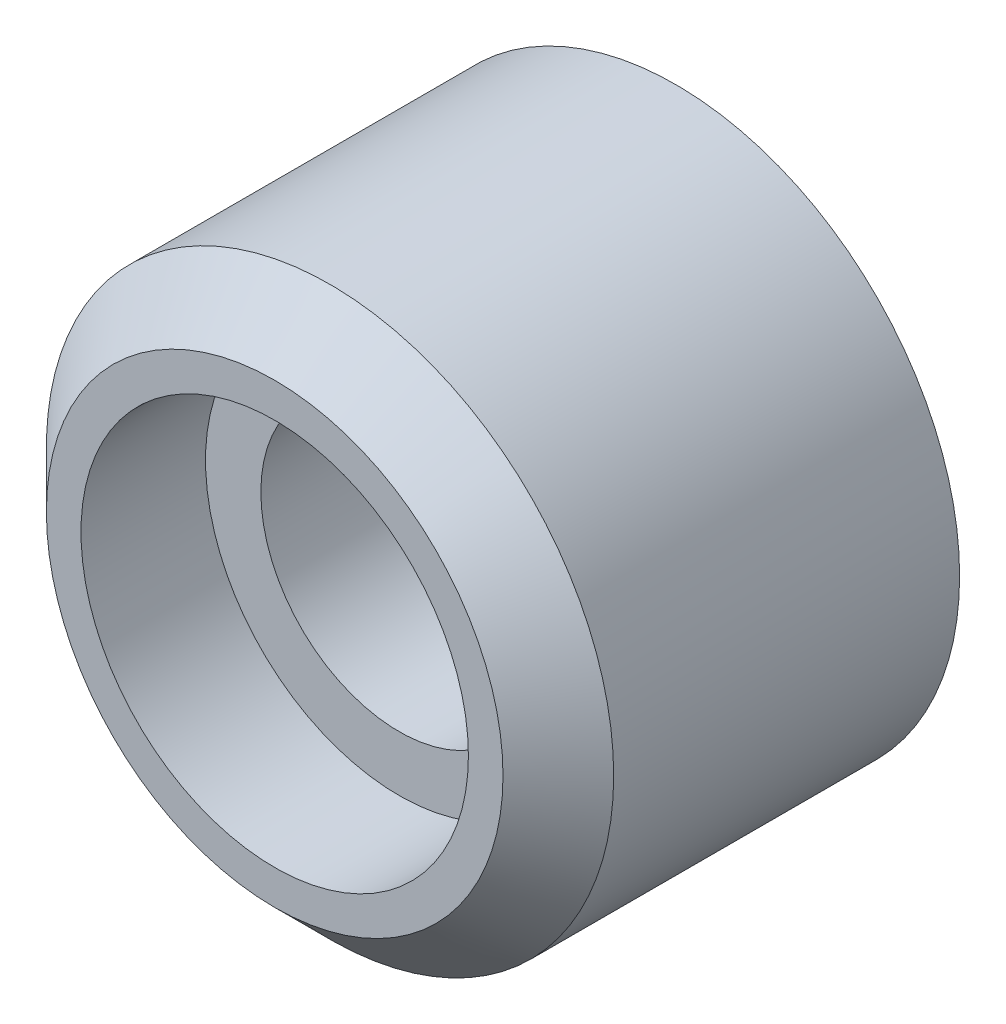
ISO-10303-21;
HEADER;
FILE_DESCRIPTION(('STEP AP214'),'2;1');
FILE_NAME('part.step','',(''),(''),'','','');
FILE_SCHEMA(('AUTOMOTIVE_DESIGN { 1 0 10303 214 1 1 1 1 }'));
ENDSEC;
DATA;
#1=APPLICATION_CONTEXT('core data for automotive mechanical design processes');
#2=APPLICATION_PROTOCOL_DEFINITION('international standard','automotive_design',2000,#1);
#3=PRODUCT_CONTEXT('',#1,'mechanical');
#4=PRODUCT('Part','Part','',(#3));
#5=PRODUCT_RELATED_PRODUCT_CATEGORY('part','',(#4));
#6=PRODUCT_DEFINITION_FORMATION('','',#4);
#7=PRODUCT_DEFINITION_CONTEXT('part definition',#1,'design');
#8=PRODUCT_DEFINITION('design','',#6,#7);
#9=PRODUCT_DEFINITION_SHAPE('','',#8);
#10=(LENGTH_UNIT() NAMED_UNIT(*) SI_UNIT(.MILLI.,.METRE.));
#11=(NAMED_UNIT(*) PLANE_ANGLE_UNIT() SI_UNIT($,.RADIAN.));
#12=(NAMED_UNIT(*) SI_UNIT($,.STERADIAN.) SOLID_ANGLE_UNIT());
#13=UNCERTAINTY_MEASURE_WITH_UNIT(LENGTH_MEASURE(1.E-05),#10,'distance_accuracy_value','');
#14=(GEOMETRIC_REPRESENTATION_CONTEXT(3) GLOBAL_UNCERTAINTY_ASSIGNED_CONTEXT((#13)) GLOBAL_UNIT_ASSIGNED_CONTEXT((#10,
#11,#12)) REPRESENTATION_CONTEXT('',''));
#15=CARTESIAN_POINT('',(0.,0.,0.));
#16=DIRECTION('',(0.,0.,1.));
#17=DIRECTION('',(1.,0.,0.));
#18=AXIS2_PLACEMENT_3D('',#15,#16,#17);
#19=CARTESIAN_POINT('',(0.,0.,-14.5));
#20=DIRECTION('',(0.,0.,1.));
#21=DIRECTION('',(1.,0.,0.));
#22=AXIS2_PLACEMENT_3D('',#19,#20,#21);
#23=CYLINDRICAL_SURFACE('',#22,5.);
#24=CARTESIAN_POINT('',(0.,0.,-14.5));
#25=DIRECTION('',(0.,0.,1.));
#26=DIRECTION('',(1.,0.,0.));
#27=AXIS2_PLACEMENT_3D('',#24,#25,#26);
#28=CIRCLE('',#27,5.);
#29=CARTESIAN_POINT('',(5.,0.,-14.5));
#30=VERTEX_POINT('',#29);
#31=EDGE_CURVE('E48',#30,#30,#28,.T.);
#32=CARTESIAN_POINT('',(0.,0.,-4.5));
#33=DIRECTION('',(0.,0.,1.));
#34=DIRECTION('',(1.,0.,0.));
#35=AXIS2_PLACEMENT_3D('',#32,#33,#34);
#36=CIRCLE('',#35,5.);
#37=CARTESIAN_POINT('',(5.,0.,-4.5));
#38=VERTEX_POINT('',#37);
#39=EDGE_CURVE('E51',#38,#38,#36,.F.);
#40=CARTESIAN_POINT('',(5.,0.,-14.5));
#41=CARTESIAN_POINT('',(5.,0.,-14.3958333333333));
#42=CARTESIAN_POINT('',(5.,0.,-14.2916666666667));
#43=CARTESIAN_POINT('',(5.,0.,-14.0833333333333));
#44=CARTESIAN_POINT('',(5.,0.,-13.9791666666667));
#45=CARTESIAN_POINT('',(5.,0.,-13.7708333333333));
#46=CARTESIAN_POINT('',(5.,0.,-13.6666666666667));
#47=CARTESIAN_POINT('',(5.,0.,-13.4583333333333));
#48=CARTESIAN_POINT('',(5.,0.,-13.3541666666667));
#49=CARTESIAN_POINT('',(5.,0.,-13.1458333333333));
#50=CARTESIAN_POINT('',(5.,0.,-13.0416666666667));
#51=CARTESIAN_POINT('',(5.,0.,-12.8333333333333));
#52=CARTESIAN_POINT('',(5.,0.,-12.7291666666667));
#53=CARTESIAN_POINT('',(5.,0.,-12.5208333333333));
#54=CARTESIAN_POINT('',(5.,0.,-12.4166666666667));
#55=CARTESIAN_POINT('',(5.,0.,-12.2083333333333));
#56=CARTESIAN_POINT('',(5.,0.,-12.1041666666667));
#57=CARTESIAN_POINT('',(5.,0.,-11.8958333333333));
#58=CARTESIAN_POINT('',(5.,0.,-11.7916666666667));
#59=CARTESIAN_POINT('',(5.,0.,-11.5833333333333));
#60=CARTESIAN_POINT('',(5.,0.,-11.4791666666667));
#61=CARTESIAN_POINT('',(5.,0.,-11.2708333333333));
#62=CARTESIAN_POINT('',(5.,0.,-11.1666666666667));
#63=CARTESIAN_POINT('',(5.,0.,-10.9583333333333));
#64=CARTESIAN_POINT('',(5.,0.,-10.8541666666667));
#65=CARTESIAN_POINT('',(5.,0.,-10.6458333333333));
#66=CARTESIAN_POINT('',(5.,0.,-10.5416666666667));
#67=CARTESIAN_POINT('',(5.,0.,-10.3333333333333));
#68=CARTESIAN_POINT('',(5.,0.,-10.2291666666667));
#69=CARTESIAN_POINT('',(5.,0.,-10.0208333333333));
#70=CARTESIAN_POINT('',(5.,0.,-9.91666666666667));
#71=CARTESIAN_POINT('',(5.,0.,-9.70833333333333));
#72=CARTESIAN_POINT('',(5.,0.,-9.60416666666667));
#73=CARTESIAN_POINT('',(5.,0.,-9.39583333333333));
#74=CARTESIAN_POINT('',(5.,0.,-9.29166666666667));
#75=CARTESIAN_POINT('',(5.,0.,-9.08333333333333));
#76=CARTESIAN_POINT('',(5.,0.,-8.97916666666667));
#77=CARTESIAN_POINT('',(5.,0.,-8.77083333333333));
#78=CARTESIAN_POINT('',(5.,0.,-8.66666666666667));
#79=CARTESIAN_POINT('',(5.,0.,-8.45833333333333));
#80=CARTESIAN_POINT('',(5.,0.,-8.35416666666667));
#81=CARTESIAN_POINT('',(5.,0.,-8.14583333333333));
#82=CARTESIAN_POINT('',(5.,0.,-8.04166666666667));
#83=CARTESIAN_POINT('',(5.,0.,-7.83333333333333));
#84=CARTESIAN_POINT('',(5.,0.,-7.72916666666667));
#85=CARTESIAN_POINT('',(5.,0.,-7.52083333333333));
#86=CARTESIAN_POINT('',(5.,0.,-7.41666666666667));
#87=CARTESIAN_POINT('',(5.,0.,-7.20833333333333));
#88=CARTESIAN_POINT('',(5.,0.,-7.10416666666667));
#89=CARTESIAN_POINT('',(5.,0.,-6.89583333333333));
#90=CARTESIAN_POINT('',(5.,0.,-6.79166666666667));
#91=CARTESIAN_POINT('',(5.,0.,-6.58333333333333));
#92=CARTESIAN_POINT('',(5.,0.,-6.47916666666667));
#93=CARTESIAN_POINT('',(5.,0.,-6.27083333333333));
#94=CARTESIAN_POINT('',(5.,0.,-6.16666666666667));
#95=CARTESIAN_POINT('',(5.,0.,-5.95833333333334));
#96=CARTESIAN_POINT('',(5.,0.,-5.85416666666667));
#97=CARTESIAN_POINT('',(5.,0.,-5.64583333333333));
#98=CARTESIAN_POINT('',(5.,0.,-5.54166666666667));
#99=CARTESIAN_POINT('',(5.,0.,-5.33333333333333));
#100=CARTESIAN_POINT('',(5.,0.,-5.22916666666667));
#101=CARTESIAN_POINT('',(5.,0.,-5.02083333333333));
#102=CARTESIAN_POINT('',(5.,0.,-4.91666666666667));
#103=CARTESIAN_POINT('',(5.,0.,-4.70833333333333));
#104=CARTESIAN_POINT('',(5.,0.,-4.60416666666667));
#105=CARTESIAN_POINT('',(5.,0.,-4.5));
#106=B_SPLINE_CURVE_WITH_KNOTS('',3,(#40,#41,#42,#43,#44,#45,#46,#47,#48,#49,#50,#51,#52,#53,
#54,#55,#56,#57,#58,#59,#60,#61,#62,#63,#64,#65,#66,#67,#68,#69,#70,#71,#72,#73,#74,#75,#76,#77,
#78,#79,#80,#81,#82,#83,#84,#85,#86,#87,#88,#89,#90,#91,#92,#93,#94,#95,#96,#97,#98,#99,#100,
#101,#102,#103,#104,#105),.UNSPECIFIED.,.F.,.F.,(4,2,2,2,2,2,2,2,2,2,2,2,2,2,2,2,2,2,2,2,2,2,2,
2,2,2,2,2,2,2,2,2,4),(0.,0.3125,0.625000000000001,0.937500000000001,1.25,1.5625,1.875,2.1875,
2.5,2.8125,3.125,3.4375,3.75,4.0625,4.375,4.6875,5.,5.3125,5.625,5.9375,6.25,6.5625,6.875,
7.1875,7.5,7.8125,8.125,8.4375,8.75,9.0625,9.375,9.6875,10.),.UNSPECIFIED.);
#107=EDGE_CURVE('BSEAM33',#30,#38,#106,.T.);
#108=ORIENTED_EDGE('',*,*,#31,.F.);
#109=ORIENTED_EDGE('',*,*,#39,.F.);
#110=ORIENTED_EDGE('',*,*,#107,.T.);
#111=ORIENTED_EDGE('',*,*,#107,.F.);
#112=EDGE_LOOP('',(#108,#110,#109,#111));
#113=FACE_BOUND('',#112,.T.);
#114=ADVANCED_FACE('F33',(#113),#23,.F.);
#115=CARTESIAN_POINT('',(0.,0.,-14.5));
#116=DIRECTION('',(0.,0.,1.));
#117=DIRECTION('',(1.,0.,0.));
#118=AXIS2_PLACEMENT_3D('',#115,#116,#117);
#119=CYLINDRICAL_SURFACE('',#118,10.25);
#120=CARTESIAN_POINT('',(0.,0.,-1.99999999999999));
#121=DIRECTION('',(0.,0.,1.));
#122=DIRECTION('',(1.,0.,0.));
#123=AXIS2_PLACEMENT_3D('',#120,#121,#122);
#124=CIRCLE('',#123,10.25);
#125=CARTESIAN_POINT('',(10.25,0.,-1.99999999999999));
#126=VERTEX_POINT('',#125);
#127=EDGE_CURVE('E10',#126,#126,#124,.F.);
#128=CARTESIAN_POINT('',(0.,0.,-14.5));
#129=DIRECTION('',(0.,0.,1.));
#130=DIRECTION('',(1.,0.,0.));
#131=AXIS2_PLACEMENT_3D('',#128,#129,#130);
#132=CIRCLE('',#131,10.25);
#133=CARTESIAN_POINT('',(10.25,0.,-14.5));
#134=VERTEX_POINT('',#133);
#135=EDGE_CURVE('E44',#134,#134,#132,.T.);
#136=CARTESIAN_POINT('',(10.25,0.,-1.99999999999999));
#137=CARTESIAN_POINT('',(10.25,0.,-2.13020833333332));
#138=CARTESIAN_POINT('',(10.25,0.,-2.26041666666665));
#139=CARTESIAN_POINT('',(10.25,0.,-2.52083333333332));
#140=CARTESIAN_POINT('',(10.25,0.,-2.65104166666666));
#141=CARTESIAN_POINT('',(10.25,0.,-2.91145833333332));
#142=CARTESIAN_POINT('',(10.25,0.,-3.04166666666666));
#143=CARTESIAN_POINT('',(10.25,0.,-3.30208333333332));
#144=CARTESIAN_POINT('',(10.25,0.,-3.43229166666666));
#145=CARTESIAN_POINT('',(10.25,0.,-3.69270833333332));
#146=CARTESIAN_POINT('',(10.25,0.,-3.82291666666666));
#147=CARTESIAN_POINT('',(10.25,0.,-4.08333333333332));
#148=CARTESIAN_POINT('',(10.25,0.,-4.21354166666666));
#149=CARTESIAN_POINT('',(10.25,0.,-4.47395833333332));
#150=CARTESIAN_POINT('',(10.25,0.,-4.60416666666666));
#151=CARTESIAN_POINT('',(10.25,0.,-4.86458333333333));
#152=CARTESIAN_POINT('',(10.25,0.,-4.99479166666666));
#153=CARTESIAN_POINT('',(10.25,0.,-5.25520833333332));
#154=CARTESIAN_POINT('',(10.25,0.,-5.38541666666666));
#155=CARTESIAN_POINT('',(10.25,0.,-5.64583333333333));
#156=CARTESIAN_POINT('',(10.25,0.,-5.77604166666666));
#157=CARTESIAN_POINT('',(10.25,0.,-6.03645833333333));
#158=CARTESIAN_POINT('',(10.25,0.,-6.16666666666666));
#159=CARTESIAN_POINT('',(10.25,0.,-6.42708333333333));
#160=CARTESIAN_POINT('',(10.25,0.,-6.55729166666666));
#161=CARTESIAN_POINT('',(10.25,0.,-6.81770833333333));
#162=CARTESIAN_POINT('',(10.25,0.,-6.94791666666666));
#163=CARTESIAN_POINT('',(10.25,0.,-7.20833333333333));
#164=CARTESIAN_POINT('',(10.25,0.,-7.33854166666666));
#165=CARTESIAN_POINT('',(10.25,0.,-7.59895833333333));
#166=CARTESIAN_POINT('',(10.25,0.,-7.72916666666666));
#167=CARTESIAN_POINT('',(10.25,0.,-7.98958333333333));
#168=CARTESIAN_POINT('',(10.25,0.,-8.11979166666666));
#169=CARTESIAN_POINT('',(10.25,0.,-8.38020833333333));
#170=CARTESIAN_POINT('',(10.25,0.,-8.51041666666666));
#171=CARTESIAN_POINT('',(10.25,0.,-8.77083333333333));
#172=CARTESIAN_POINT('',(10.25,0.,-8.90104166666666));
#173=CARTESIAN_POINT('',(10.25,0.,-9.16145833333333));
#174=CARTESIAN_POINT('',(10.25,0.,-9.29166666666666));
#175=CARTESIAN_POINT('',(10.25,0.,-9.55208333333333));
#176=CARTESIAN_POINT('',(10.25,0.,-9.68229166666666));
#177=CARTESIAN_POINT('',(10.25,0.,-9.94270833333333));
#178=CARTESIAN_POINT('',(10.25,0.,-10.0729166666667));
#179=CARTESIAN_POINT('',(10.25,0.,-10.3333333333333));
#180=CARTESIAN_POINT('',(10.25,0.,-10.4635416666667));
#181=CARTESIAN_POINT('',(10.25,0.,-10.7239583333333));
#182=CARTESIAN_POINT('',(10.25,0.,-10.8541666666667));
#183=CARTESIAN_POINT('',(10.25,0.,-11.1145833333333));
#184=CARTESIAN_POINT('',(10.25,0.,-11.2447916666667));
#185=CARTESIAN_POINT('',(10.25,0.,-11.5052083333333));
#186=CARTESIAN_POINT('',(10.25,0.,-11.6354166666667));
#187=CARTESIAN_POINT('',(10.25,0.,-11.8958333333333));
#188=CARTESIAN_POINT('',(10.25,0.,-12.0260416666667));
#189=CARTESIAN_POINT('',(10.25,0.,-12.2864583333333));
#190=CARTESIAN_POINT('',(10.25,0.,-12.4166666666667));
#191=CARTESIAN_POINT('',(10.25,0.,-12.6770833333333));
#192=CARTESIAN_POINT('',(10.25,0.,-12.8072916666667));
#193=CARTESIAN_POINT('',(10.25,0.,-13.0677083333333));
#194=CARTESIAN_POINT('',(10.25,0.,-13.1979166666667));
#195=CARTESIAN_POINT('',(10.25,0.,-13.4583333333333));
#196=CARTESIAN_POINT('',(10.25,0.,-13.5885416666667));
#197=CARTESIAN_POINT('',(10.25,0.,-13.8489583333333));
#198=CARTESIAN_POINT('',(10.25,0.,-13.9791666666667));
#199=CARTESIAN_POINT('',(10.25,0.,-14.2395833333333));
#200=CARTESIAN_POINT('',(10.25,0.,-14.3697916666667));
#201=CARTESIAN_POINT('',(10.25,0.,-14.5));
#202=B_SPLINE_CURVE_WITH_KNOTS('',3,(#136,#137,#138,#139,#140,#141,#142,#143,#144,#145,#146,
#147,#148,#149,#150,#151,#152,#153,#154,#155,#156,#157,#158,#159,#160,#161,#162,#163,#164,#165,
#166,#167,#168,#169,#170,#171,#172,#173,#174,#175,#176,#177,#178,#179,#180,#181,#182,#183,#184,
#185,#186,#187,#188,#189,#190,#191,#192,#193,#194,#195,#196,#197,#198,#199,#200,#201),
.UNSPECIFIED.,.F.,.F.,(4,2,2,2,2,2,2,2,2,2,2,2,2,2,2,2,2,2,2,2,2,2,2,2,2,2,2,2,2,2,2,2,4),(0.,
0.390625,0.781250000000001,1.171875,1.5625,1.953125,2.34375,2.734375,3.125,3.515625,3.90625,
4.29687500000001,4.68750000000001,5.07812500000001,5.46875000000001,5.85937500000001,
6.25000000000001,6.64062500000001,7.03125000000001,7.42187500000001,7.81250000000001,
8.20312500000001,8.59375000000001,8.98437500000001,9.37500000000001,9.76562500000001,10.15625,
10.546875,10.9375,11.328125,11.71875,12.109375,12.5),.UNSPECIFIED.);
#203=EDGE_CURVE('BSEAM81',#126,#134,#202,.T.);
#204=ORIENTED_EDGE('',*,*,#127,.T.);
#205=ORIENTED_EDGE('',*,*,#135,.T.);
#206=ORIENTED_EDGE('',*,*,#203,.T.);
#207=ORIENTED_EDGE('',*,*,#203,.F.);
#208=EDGE_LOOP('',(#204,#206,#205,#207));
#209=FACE_BOUND('',#208,.T.);
#210=ADVANCED_FACE('F81',(#209),#119,.T.);
#211=CARTESIAN_POINT('',(0.,0.,-14.5));
#212=DIRECTION('',(0.,0.,1.));
#213=DIRECTION('',(1.,0.,0.));
#214=AXIS2_PLACEMENT_3D('',#211,#212,#213);
#215=PLANE('',#214);
#216=ORIENTED_EDGE('',*,*,#31,.T.);
#217=EDGE_LOOP('',(#216));
#218=FACE_BOUND('',#217,.T.);
#219=ORIENTED_EDGE('',*,*,#135,.F.);
#220=EDGE_LOOP('',(#219));
#221=FACE_BOUND('',#220,.T.);
#222=ADVANCED_FACE('F74',(#218,#221),#215,.F.);
#223=CARTESIAN_POINT('',(0.,0.,0.));
#224=DIRECTION('',(0.,0.,1.));
#225=DIRECTION('',(1.,0.,0.));
#226=AXIS2_PLACEMENT_3D('',#223,#224,#225);
#227=PLANE('',#226);
#228=CARTESIAN_POINT('',(0.,0.,0.));
#229=DIRECTION('',(0.,0.,1.));
#230=DIRECTION('',(1.,0.,0.));
#231=AXIS2_PLACEMENT_3D('',#228,#229,#230);
#232=CIRCLE('',#231,8.25000000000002);
#233=CARTESIAN_POINT('',(8.25000000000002,0.,0.));
#234=VERTEX_POINT('',#233);
#235=EDGE_CURVE('E40',#234,#234,#232,.T.);
#236=ORIENTED_EDGE('',*,*,#235,.T.);
#237=EDGE_LOOP('',(#236));
#238=FACE_BOUND('',#237,.T.);
#239=CARTESIAN_POINT('',(0.,0.,0.));
#240=DIRECTION('',(0.,0.,1.));
#241=DIRECTION('',(1.,0.,0.));
#242=AXIS2_PLACEMENT_3D('',#239,#240,#241);
#243=CIRCLE('',#242,7.);
#244=CARTESIAN_POINT('',(7.,0.,0.));
#245=VERTEX_POINT('',#244);
#246=EDGE_CURVE('E57',#245,#245,#243,.T.);
#247=ORIENTED_EDGE('',*,*,#246,.F.);
#248=EDGE_LOOP('',(#247));
#249=FACE_BOUND('',#248,.T.);
#250=ADVANCED_FACE('F72',(#238,#249),#227,.T.);
#251=CARTESIAN_POINT('',(0.,0.,-4.5));
#252=DIRECTION('',(0.,0.,1.));
#253=DIRECTION('',(1.,0.,0.));
#254=AXIS2_PLACEMENT_3D('',#251,#252,#253);
#255=PLANE('',#254);
#256=CARTESIAN_POINT('',(0.,0.,-4.5));
#257=DIRECTION('',(0.,0.,1.));
#258=DIRECTION('',(1.,0.,0.));
#259=AXIS2_PLACEMENT_3D('',#256,#257,#258);
#260=CIRCLE('',#259,7.);
#261=CARTESIAN_POINT('',(7.,0.,-4.5));
#262=VERTEX_POINT('',#261);
#263=EDGE_CURVE('E53',#262,#262,#260,.T.);
#264=ORIENTED_EDGE('',*,*,#263,.T.);
#265=EDGE_LOOP('',(#264));
#266=FACE_BOUND('',#265,.T.);
#267=ORIENTED_EDGE('',*,*,#39,.T.);
#268=EDGE_LOOP('',(#267));
#269=FACE_BOUND('',#268,.T.);
#270=ADVANCED_FACE('F63',(#266,#269),#255,.T.);
#271=CARTESIAN_POINT('',(0.,0.,-4.5));
#272=DIRECTION('',(0.,0.,1.));
#273=DIRECTION('',(1.,0.,0.));
#274=AXIS2_PLACEMENT_3D('',#271,#272,#273);
#275=CYLINDRICAL_SURFACE('',#274,7.);
#276=ORIENTED_EDGE('',*,*,#263,.F.);
#277=EDGE_LOOP('',(#276));
#278=FACE_BOUND('',#277,.T.);
#279=ORIENTED_EDGE('',*,*,#246,.T.);
#280=EDGE_LOOP('',(#279));
#281=FACE_BOUND('',#280,.T.);
#282=ADVANCED_FACE('F66',(#278,#281),#275,.F.);
#283=CARTESIAN_POINT('',(0.,0.,0.));
#284=DIRECTION('',(0.,0.,-1.));
#285=DIRECTION('',(-1.,0.,0.));
#286=AXIS2_PLACEMENT_3D('',#283,#284,#285);
#287=CONICAL_SURFACE('',#286,8.25000000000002,0.785398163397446);
#288=ORIENTED_EDGE('',*,*,#127,.F.);
#289=EDGE_LOOP('',(#288));
#290=FACE_BOUND('',#289,.T.);
#291=ORIENTED_EDGE('',*,*,#235,.F.);
#292=EDGE_LOOP('',(#291));
#293=FACE_BOUND('',#292,.T.);
#294=ADVANCED_FACE('F35',(#290,#293),#287,.T.);
#295=CLOSED_SHELL('',(#114,#210,#222,#250,#270,#282,#294));
#296=MANIFOLD_SOLID_BREP('B2',#295);
#297=ADVANCED_BREP_SHAPE_REPRESENTATION('',(#18,#296),#14);
#298=SHAPE_DEFINITION_REPRESENTATION(#9,#297);
ENDSEC;
END-ISO-10303-21;
